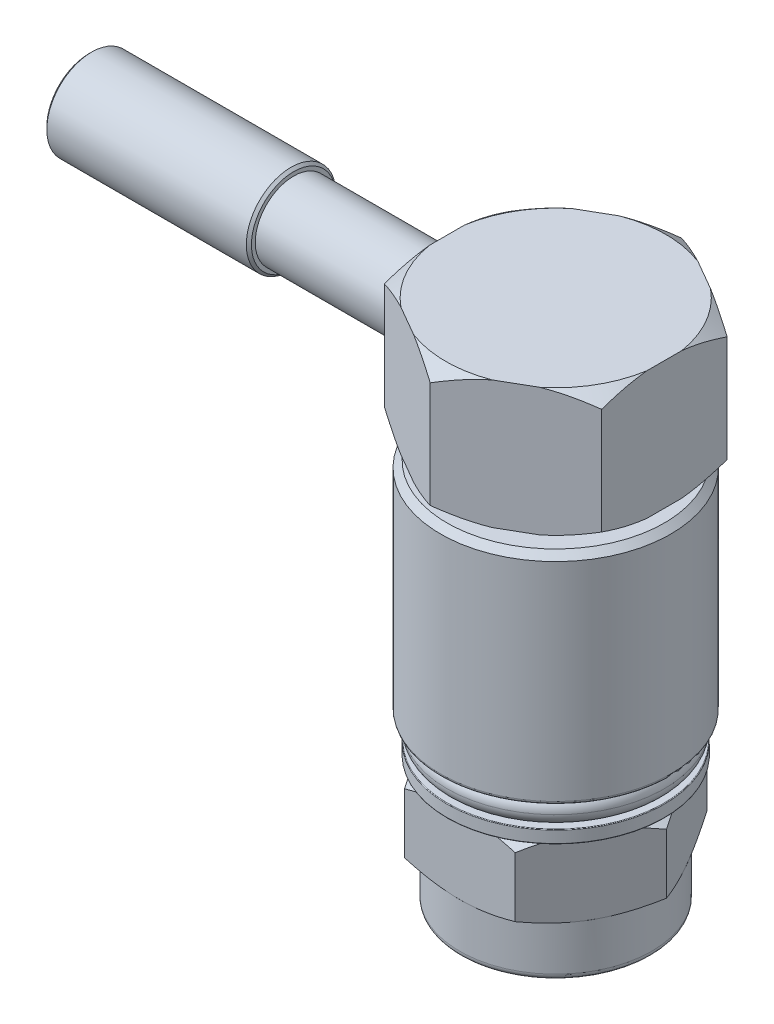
from build123d import *

# Parameters (mm, degrees)
BOSS_EXTRUDE1_DEPTH = 10
SKETCH4_R           = 5.5
BOSS_EXTRUDE2_DEPTH = 10
SKETCH5_R           = 9
BOSS_EXTRUDE3_DEPTH = 17
CHAMFER1_SIZE       = 0.5
FILLET1_R           = 0.25
BOSS_EXTRUDE4_DEPTH = 6


with BuildPart() as part:
    # Sketch1 → Boss-Extrude1 (new body)
    with BuildSketch(Plane(origin=(0, 0, 0), x_dir=(1, 0, 0), z_dir=(0, 1, 0))):
        Polygon((0, 9.814954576), (-8.5, 4.907477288), (-8.5, -4.907477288), (0, -9.814954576), (8.5, -4.907477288), (8.5, 4.907477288), align=None)
    extrude(amount=BOSS_EXTRUDE1_DEPTH)

    # Sketch3 → Cut-Revolve2 (revolve, cut)
    with BuildSketch(Plane(origin=(0, 0, 0), x_dir=(0, 0, -1), z_dir=(1, 0, 0))):
        Polygon((-9.914954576, 9.08469907), (-8.464954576, 10.1), (-9.914954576, 10.1), align=None)
        Polygon((-9.914954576, 0.91530093), (-9.914954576, -0.1), (-8.464954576, -0.1), align=None)
    revolve(axis=Axis((0, 10, 0), (0, -1, 0)), mode=Mode.SUBTRACT)

    # Sketch4 → Boss-Extrude2 (add)
    with BuildSketch(Plane.XZ):
        with Locations(Location((0, 0, 0), (0, 0, 90))):
            Circle(SKETCH4_R)
    extrude(amount=BOSS_EXTRUDE2_DEPTH)

    # Sketch5 → Boss-Extrude3 (add)
    with BuildSketch(Plane.XZ.offset(1)):
        with Locations(Location((0, 0, 0), (0, 0, 270))):
            Circle(SKETCH5_R)
    extrude(amount=BOSS_EXTRUDE3_DEPTH)

    # Chamfer1
    chamfer1_edges = [part.edges().sort_by_distance(p)[0] for p in [
        (0, -1, 9),
    ]]
    chamfer(chamfer1_edges, length=CHAMFER1_SIZE)

    # Sketch8 → Revolve1 (revolve)
    with BuildSketch(Plane.XY):
        Polygon((-36.3, 8.5), (-36.5, 8.3), (-36.5, 7.5), (-36.4, 7.5), (-36.4, 5), (-8.5, 5), (-8.5, 8), (-20.5, 8), (-20.5, 8.3), (-20.7, 8.5), align=None)
    revolve(axis=Axis((-8.5, 5, 0), (-1, 0, 0)))

    # Fillet1
    fillet1_edges = [part.edges().sort_by_distance(p)[0] for p in [
        (0, -18, 9),
    ]]
    fillet(fillet1_edges, radius=FILLET1_R)

    # Sketch9 → Revolve2 (revolve)
    with BuildSketch(Plane(origin=(0, 0, 0), x_dir=(0, 0, -1), z_dir=(1, 0, 0))):
        with BuildLine():
            Line((0, -18), (-7.501, -18))
            ThreePointArc((-7.501, -18), (-8.207399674, -18.292600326), (-8.5, -18.999))
            Line((-8.5, -18.999), (-8.5, -19.001))
            ThreePointArc((-8.5, -19.001), (-8.207399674, -19.707399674), (-7.501, -20))
            Line((-7.501, -20), (-8.45, -20))
            ThreePointArc((-8.45, -20), (-8.485355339, -20.014644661), (-8.5, -20.05))
            Line((-8.5, -20.05), (-8.5, -20.95))
            ThreePointArc((-8.5, -20.95), (-8.485355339, -20.985355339), (-8.45, -21))
            Line((-8.45, -21), (0, -21))
            Line((0, -21), (0, -18))
        make_face()
    revolve(axis=Axis((0, -18, 0), (0, -1, 0)))

    # Sketch10 → Boss-Extrude4 (add)
    with BuildSketch(Plane.XZ.offset(21)):
        Polygon((8.660254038, 0), (4.330127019, 7.5), (-4.330127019, 7.5), (-8.660254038, 0), (-4.330127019, -7.5), (4.330127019, -7.5), align=None)
    extrude(amount=BOSS_EXTRUDE4_DEPTH)

    # Sketch11 → Cut-Revolve3 (revolve, cut)
    with BuildSketch(Plane.XY):
        Polygon((-7.510254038, -21), (-8.760254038, -21), (-8.760254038, -21.721687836), align=None)
        Polygon((-8.760254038, -26.278312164), (-7.510254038, -27), (-8.760254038, -27), align=None)
    revolve(axis=Axis((0, -24, 0), (0, -1, 0)), mode=Mode.SUBTRACT)

    # Sketch12 → Revolve3 (revolve)
    with BuildSketch(Plane.XY):
        with BuildLine():
            Line((-7.510254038, -27), (-7.510254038, -30.5))
            ThreePointArc((-7.510254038, -30.5), (-7.363807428, -30.853553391), (-7.010254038, -31))
            Line((-7.010254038, -31), (-6.520254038, -31))
            Line((-6.520254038, -31), (-6.520254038, -30.9))
            Line((-6.520254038, -30.9), (-6.510254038, -30.9))
            Line((-6.510254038, -30.9), (-6.510254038, -31))
            Line((-6.510254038, -31), (0, -31))
            Line((0, -31), (0, -27))
            Line((0, -27), (-7.510254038, -27))
        make_face()
    revolve(axis=Axis((0, -27, 0), (0, -1, 0)))


solid = part.part
